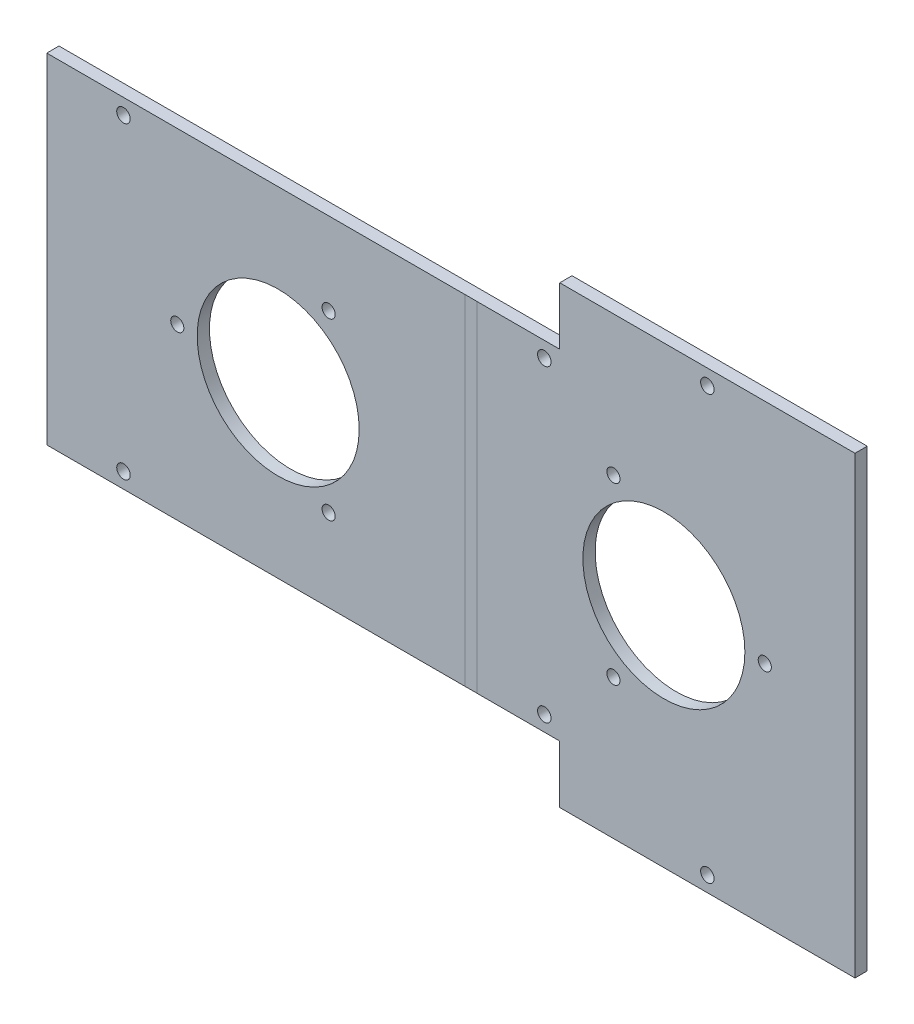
ISO-10303-21;
HEADER;
FILE_DESCRIPTION(('STEP AP214'),'2;1');
FILE_NAME('part.step','',(''),(''),'','','');
FILE_SCHEMA(('AUTOMOTIVE_DESIGN { 1 0 10303 214 1 1 1 1 }'));
ENDSEC;
DATA;
#1=APPLICATION_CONTEXT('core data for automotive mechanical design processes');
#2=APPLICATION_PROTOCOL_DEFINITION('international standard','automotive_design',2000,#1);
#3=PRODUCT_CONTEXT('',#1,'mechanical');
#4=PRODUCT('Part','Part','',(#3));
#5=PRODUCT_RELATED_PRODUCT_CATEGORY('part','',(#4));
#6=PRODUCT_DEFINITION_FORMATION('','',#4);
#7=PRODUCT_DEFINITION_CONTEXT('part definition',#1,'design');
#8=PRODUCT_DEFINITION('design','',#6,#7);
#9=PRODUCT_DEFINITION_SHAPE('','',#8);
#10=(LENGTH_UNIT() NAMED_UNIT(*) SI_UNIT(.MILLI.,.METRE.));
#11=(NAMED_UNIT(*) PLANE_ANGLE_UNIT() SI_UNIT($,.RADIAN.));
#12=(NAMED_UNIT(*) SI_UNIT($,.STERADIAN.) SOLID_ANGLE_UNIT());
#13=UNCERTAINTY_MEASURE_WITH_UNIT(LENGTH_MEASURE(1.E-05),#10,'distance_accuracy_value','');
#14=(GEOMETRIC_REPRESENTATION_CONTEXT(3) GLOBAL_UNCERTAINTY_ASSIGNED_CONTEXT((#13)) GLOBAL_UNIT_ASSIGNED_CONTEXT((#10,
#11,#12)) REPRESENTATION_CONTEXT('',''));
#15=CARTESIAN_POINT('',(0.,0.,0.));
#16=DIRECTION('',(0.,0.,1.));
#17=DIRECTION('',(1.,0.,0.));
#18=AXIS2_PLACEMENT_3D('',#15,#16,#17);
#19=CARTESIAN_POINT('',(-66.5,-500000.,114.05));
#20=DIRECTION('',(0.,0.,-1.));
#21=DIRECTION('',(-1.,0.,0.));
#22=AXIS2_PLACEMENT_3D('',#19,#20,#21);
#23=PLANE('',#22);
#24=CARTESIAN_POINT('',(80.4205213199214,-22.6543216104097,114.05));
#25=DIRECTION('',(0.,0.,1.));
#26=DIRECTION('',(1.,0.,0.));
#27=AXIS2_PLACEMENT_3D('',#24,#25,#26);
#28=CIRCLE('',#27,1.7);
#29=CARTESIAN_POINT('',(82.1205213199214,-22.6543216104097,114.05));
#30=VERTEX_POINT('',#29);
#31=EDGE_CURVE('E200',#30,#30,#28,.T.);
#32=ORIENTED_EDGE('',*,*,#31,.F.);
#33=EDGE_LOOP('',(#32));
#34=FACE_BOUND('',#33,.T.);
#35=CARTESIAN_POINT('',(119.658957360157,0.,114.05));
#36=DIRECTION('',(0.,0.,1.));
#37=DIRECTION('',(1.,0.,0.));
#38=AXIS2_PLACEMENT_3D('',#35,#36,#37);
#39=CIRCLE('',#38,1.70000000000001);
#40=CARTESIAN_POINT('',(121.358957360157,0.,114.05));
#41=VERTEX_POINT('',#40);
#42=EDGE_CURVE('E196',#41,#41,#39,.T.);
#43=ORIENTED_EDGE('',*,*,#42,.F.);
#44=EDGE_LOOP('',(#43));
#45=FACE_BOUND('',#44,.T.);
#46=CARTESIAN_POINT('',(93.5,0.,114.05));
#47=DIRECTION('',(0.,0.,1.));
#48=DIRECTION('',(1.,0.,0.));
#49=AXIS2_PLACEMENT_3D('',#46,#47,#48);
#50=CIRCLE('',#49,21.);
#51=CARTESIAN_POINT('',(114.5,0.,114.05));
#52=VERTEX_POINT('',#51);
#53=EDGE_CURVE('E206',#52,#52,#50,.T.);
#54=ORIENTED_EDGE('',*,*,#53,.F.);
#55=EDGE_LOOP('',(#54));
#56=FACE_BOUND('',#55,.T.);
#57=CARTESIAN_POINT('',(80.4205213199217,22.6543216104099,114.05));
#58=DIRECTION('',(0.,0.,1.));
#59=DIRECTION('',(1.,0.,0.));
#60=AXIS2_PLACEMENT_3D('',#57,#58,#59);
#61=CIRCLE('',#60,1.7);
#62=CARTESIAN_POINT('',(82.1205213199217,22.6543216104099,114.05));
#63=VERTEX_POINT('',#62);
#64=EDGE_CURVE('E199',#63,#63,#61,.T.);
#65=ORIENTED_EDGE('',*,*,#64,.F.);
#66=EDGE_LOOP('',(#65));
#67=FACE_BOUND('',#66,.T.);
#68=CARTESIAN_POINT('',(62.5,-39.99,114.05));
#69=DIRECTION('',(0.,0.,1.));
#70=DIRECTION('',(1.,0.,0.));
#71=AXIS2_PLACEMENT_3D('',#68,#69,#70);
#72=CIRCLE('',#71,1.75);
#73=CARTESIAN_POINT('',(64.25,-39.99,114.05));
#74=VERTEX_POINT('',#73);
#75=EDGE_CURVE('E174',#74,#74,#72,.T.);
#76=ORIENTED_EDGE('',*,*,#75,.F.);
#77=EDGE_LOOP('',(#76));
#78=FACE_BOUND('',#77,.T.);
#79=CARTESIAN_POINT('',(104.775,54.9125,114.05));
#80=DIRECTION('',(0.,0.,1.));
#81=DIRECTION('',(1.,0.,0.));
#82=AXIS2_PLACEMENT_3D('',#79,#80,#81);
#83=CIRCLE('',#82,1.75);
#84=CARTESIAN_POINT('',(106.525,54.9125,114.05));
#85=VERTEX_POINT('',#84);
#86=EDGE_CURVE('E186',#85,#85,#83,.T.);
#87=ORIENTED_EDGE('',*,*,#86,.F.);
#88=EDGE_LOOP('',(#87));
#89=FACE_BOUND('',#88,.T.);
#90=CARTESIAN_POINT('',(62.5,39.99,114.05));
#91=DIRECTION('',(0.,0.,1.));
#92=DIRECTION('',(1.,0.,0.));
#93=AXIS2_PLACEMENT_3D('',#90,#91,#92);
#94=CIRCLE('',#93,1.75);
#95=CARTESIAN_POINT('',(64.25,39.99,114.05));
#96=VERTEX_POINT('',#95);
#97=EDGE_CURVE('E173',#96,#96,#94,.T.);
#98=ORIENTED_EDGE('',*,*,#97,.F.);
#99=EDGE_LOOP('',(#98));
#100=FACE_BOUND('',#99,.T.);
#101=CARTESIAN_POINT('',(104.775,-54.9125,114.05));
#102=DIRECTION('',(0.,0.,1.));
#103=DIRECTION('',(1.,0.,0.));
#104=AXIS2_PLACEMENT_3D('',#101,#102,#103);
#105=CIRCLE('',#104,1.75);
#106=CARTESIAN_POINT('',(106.525,-54.9125,114.05));
#107=VERTEX_POINT('',#106);
#108=EDGE_CURVE('E160',#107,#107,#105,.T.);
#109=ORIENTED_EDGE('',*,*,#108,.F.);
#110=EDGE_LOOP('',(#109));
#111=FACE_BOUND('',#110,.T.);
#112=DIRECTION('',(-1.,0.,0.));
#113=VECTOR('',#112,1.);
#114=CARTESIAN_POINT('',(-66.5,43.99,114.05));
#115=LINE('',#114,#113);
#116=CARTESIAN_POINT('',(66.5,43.990000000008,114.05));
#117=VERTEX_POINT('',#116);
#118=CARTESIAN_POINT('',(45.0875,43.99,114.05));
#119=VERTEX_POINT('',#118);
#120=EDGE_CURVE('E284',#117,#119,#115,.T.);
#121=ORIENTED_EDGE('',*,*,#120,.T.);
#122=DIRECTION('',(0.,1.,0.));
#123=VECTOR('',#122,1.);
#124=CARTESIAN_POINT('',(45.0875,-43.99,114.05));
#125=LINE('',#124,#123);
#126=CARTESIAN_POINT('',(45.0875,-43.99,114.05));
#127=VERTEX_POINT('',#126);
#128=EDGE_CURVE('E130',#127,#119,#125,.T.);
#129=ORIENTED_EDGE('',*,*,#128,.F.);
#130=DIRECTION('',(-1.,0.,0.));
#131=VECTOR('',#130,1.);
#132=CARTESIAN_POINT('',(-66.5,-43.990000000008,114.05));
#133=LINE('',#132,#131);
#134=CARTESIAN_POINT('',(66.5,-43.990000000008,114.05));
#135=VERTEX_POINT('',#134);
#136=EDGE_CURVE('E11',#135,#127,#133,.T.);
#137=ORIENTED_EDGE('',*,*,#136,.F.);
#138=DIRECTION('',(0.,1.,0.));
#139=VECTOR('',#138,1.);
#140=CARTESIAN_POINT('',(66.5,-500000.,114.05));
#141=LINE('',#140,#139);
#142=CARTESIAN_POINT('',(66.5,-58.9125000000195,114.05));
#143=VERTEX_POINT('',#142);
#144=EDGE_CURVE('E251',#143,#135,#141,.T.);
#145=ORIENTED_EDGE('',*,*,#144,.F.);
#146=DIRECTION('',(-1.,0.,0.));
#147=VECTOR('',#146,1.);
#148=CARTESIAN_POINT('',(66.5,-58.9125000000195,114.05));
#149=LINE('',#148,#147);
#150=CARTESIAN_POINT('',(143.05,-58.9125000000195,114.05));
#151=VERTEX_POINT('',#150);
#152=EDGE_CURVE('E243',#151,#143,#149,.T.);
#153=ORIENTED_EDGE('',*,*,#152,.F.);
#154=DIRECTION('',(0.,1.,0.));
#155=VECTOR('',#154,1.);
#156=CARTESIAN_POINT('',(143.05,-500000.,114.05));
#157=LINE('',#156,#155);
#158=CARTESIAN_POINT('',(143.05,58.9125,114.05));
#159=VERTEX_POINT('',#158);
#160=EDGE_CURVE('E264',#151,#159,#157,.T.);
#161=ORIENTED_EDGE('',*,*,#160,.T.);
#162=DIRECTION('',(-1.,0.,0.));
#163=VECTOR('',#162,1.);
#164=CARTESIAN_POINT('',(66.5,58.9125,114.05));
#165=LINE('',#164,#163);
#166=CARTESIAN_POINT('',(66.5,58.9125,114.05));
#167=VERTEX_POINT('',#166);
#168=EDGE_CURVE('E248',#159,#167,#165,.T.);
#169=ORIENTED_EDGE('',*,*,#168,.T.);
#170=EDGE_CURVE('E266',#117,#167,#141,.T.);
#171=ORIENTED_EDGE('',*,*,#170,.F.);
#172=EDGE_LOOP('',(#121,#129,#137,#145,#153,#161,#169,#171));
#173=FACE_BOUND('',#172,.T.);
#174=ADVANCED_FACE('F34',(#34,#45,#56,#67,#78,#89,#100,#111,#173),#23,.F.);
#175=CARTESIAN_POINT('',(0.,-43.99,-240.705250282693));
#176=DIRECTION('',(0.,-1.,0.));
#177=DIRECTION('',(0.,0.,1.));
#178=AXIS2_PLACEMENT_3D('',#175,#176,#177);
#179=PLANE('',#178);
#180=DIRECTION('',(0.,0.,1.));
#181=VECTOR('',#180,1.);
#182=CARTESIAN_POINT('',(45.0875,-43.99,114.04));
#183=LINE('',#182,#181);
#184=CARTESIAN_POINT('',(45.0875,-43.99,114.04));
#185=VERTEX_POINT('',#184);
#186=EDGE_CURVE('E154',#185,#127,#183,.T.);
#187=ORIENTED_EDGE('',*,*,#186,.F.);
#188=DIRECTION('',(1.,0.,0.));
#189=VECTOR('',#188,1.);
#190=CARTESIAN_POINT('',(41.9125,-43.99,114.04));
#191=LINE('',#190,#189);
#192=CARTESIAN_POINT('',(41.9125,-43.99,114.04));
#193=VERTEX_POINT('',#192);
#194=EDGE_CURVE('E134',#193,#185,#191,.T.);
#195=ORIENTED_EDGE('',*,*,#194,.F.);
#196=DIRECTION('',(0.,0.,1.));
#197=VECTOR('',#196,1.);
#198=CARTESIAN_POINT('',(41.9125,-43.99,114.04));
#199=LINE('',#198,#197);
#200=CARTESIAN_POINT('',(41.9125,-43.99,114.05));
#201=VERTEX_POINT('',#200);
#202=EDGE_CURVE('E157',#193,#201,#199,.T.);
#203=ORIENTED_EDGE('',*,*,#202,.T.);
#204=CARTESIAN_POINT('',(-66.5,-43.990000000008,114.05));
#205=VERTEX_POINT('',#204);
#206=EDGE_CURVE('E43',#201,#205,#133,.T.);
#207=ORIENTED_EDGE('',*,*,#206,.T.);
#208=DIRECTION('',(0.,0.,-1.));
#209=VECTOR('',#208,1.);
#210=CARTESIAN_POINT('',(-66.5,-43.990000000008,114.05));
#211=LINE('',#210,#209);
#212=CARTESIAN_POINT('',(-66.5,-43.990000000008,110.875));
#213=VERTEX_POINT('',#212);
#214=EDGE_CURVE('E292',#205,#213,#211,.T.);
#215=ORIENTED_EDGE('',*,*,#214,.T.);
#216=DIRECTION('',(1.,0.,0.));
#217=VECTOR('',#216,1.);
#218=CARTESIAN_POINT('',(-66.5,-43.990000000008,110.875));
#219=LINE('',#218,#217);
#220=CARTESIAN_POINT('',(66.5,-43.990000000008,110.875));
#221=VERTEX_POINT('',#220);
#222=EDGE_CURVE('E38',#213,#221,#219,.T.);
#223=ORIENTED_EDGE('',*,*,#222,.T.);
#224=DIRECTION('',(0.,0.,1.));
#225=VECTOR('',#224,1.);
#226=CARTESIAN_POINT('',(66.5,-43.990000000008,114.05));
#227=LINE('',#226,#225);
#228=EDGE_CURVE('E295',#221,#135,#227,.T.);
#229=ORIENTED_EDGE('',*,*,#228,.T.);
#230=ORIENTED_EDGE('',*,*,#136,.T.);
#231=EDGE_LOOP('',(#187,#195,#203,#207,#215,#223,#229,#230));
#232=FACE_BOUND('',#231,.T.);
#233=ADVANCED_FACE('F36',(#232),#179,.T.);
#234=CARTESIAN_POINT('',(0.,43.99,0.));
#235=DIRECTION('',(0.,-1.,0.));
#236=DIRECTION('',(0.,0.,-1.));
#237=AXIS2_PLACEMENT_3D('',#234,#235,#236);
#238=PLANE('',#237);
#239=DIRECTION('',(-1.,0.,0.));
#240=VECTOR('',#239,1.);
#241=CARTESIAN_POINT('',(45.0875,43.99,114.04));
#242=LINE('',#241,#240);
#243=CARTESIAN_POINT('',(45.0875,43.99,114.04));
#244=VERTEX_POINT('',#243);
#245=CARTESIAN_POINT('',(41.9125,43.99,114.04));
#246=VERTEX_POINT('',#245);
#247=EDGE_CURVE('E140',#244,#246,#242,.T.);
#248=ORIENTED_EDGE('',*,*,#247,.F.);
#249=DIRECTION('',(0.,0.,1.));
#250=VECTOR('',#249,1.);
#251=CARTESIAN_POINT('',(45.0875,43.99,114.04));
#252=LINE('',#251,#250);
#253=EDGE_CURVE('E124',#244,#119,#252,.T.);
#254=ORIENTED_EDGE('',*,*,#253,.T.);
#255=ORIENTED_EDGE('',*,*,#120,.F.);
#256=DIRECTION('',(0.,0.,1.));
#257=VECTOR('',#256,1.);
#258=CARTESIAN_POINT('',(66.5,43.99,114.05));
#259=LINE('',#258,#257);
#260=CARTESIAN_POINT('',(66.5,43.99,110.875));
#261=VERTEX_POINT('',#260);
#262=EDGE_CURVE('E281',#261,#117,#259,.T.);
#263=ORIENTED_EDGE('',*,*,#262,.F.);
#264=DIRECTION('',(1.,0.,0.));
#265=VECTOR('',#264,1.);
#266=CARTESIAN_POINT('',(-66.5,43.99,110.875));
#267=LINE('',#266,#265);
#268=CARTESIAN_POINT('',(-66.5,43.99,110.875));
#269=VERTEX_POINT('',#268);
#270=EDGE_CURVE('E279',#269,#261,#267,.T.);
#271=ORIENTED_EDGE('',*,*,#270,.F.);
#272=DIRECTION('',(0.,0.,-1.));
#273=VECTOR('',#272,1.);
#274=CARTESIAN_POINT('',(-66.5,43.99,114.05));
#275=LINE('',#274,#273);
#276=CARTESIAN_POINT('',(-66.5,43.99,114.05));
#277=VERTEX_POINT('',#276);
#278=EDGE_CURVE('E255',#277,#269,#275,.T.);
#279=ORIENTED_EDGE('',*,*,#278,.F.);
#280=CARTESIAN_POINT('',(41.9125,43.99,114.05));
#281=VERTEX_POINT('',#280);
#282=EDGE_CURVE('E287',#281,#277,#115,.T.);
#283=ORIENTED_EDGE('',*,*,#282,.F.);
#284=DIRECTION('',(0.,0.,1.));
#285=VECTOR('',#284,1.);
#286=CARTESIAN_POINT('',(41.9125,43.99,114.04));
#287=LINE('',#286,#285);
#288=EDGE_CURVE('E51',#246,#281,#287,.T.);
#289=ORIENTED_EDGE('',*,*,#288,.F.);
#290=EDGE_LOOP('',(#248,#254,#255,#263,#271,#279,#283,#289));
#291=FACE_BOUND('',#290,.T.);
#292=ADVANCED_FACE('F145',(#291),#238,.F.);
#293=CARTESIAN_POINT('',(-66.5,-500000.,110.875));
#294=DIRECTION('',(0.,0.,1.));
#295=DIRECTION('',(1.,0.,0.));
#296=AXIS2_PLACEMENT_3D('',#293,#294,#295);
#297=PLANE('',#296);
#298=CARTESIAN_POINT('',(104.775,-54.9125,110.875));
#299=DIRECTION('',(0.,0.,1.));
#300=DIRECTION('',(1.,0.,0.));
#301=AXIS2_PLACEMENT_3D('',#298,#299,#300);
#302=CIRCLE('',#301,1.75);
#303=CARTESIAN_POINT('',(106.525,-54.9125,110.875));
#304=VERTEX_POINT('',#303);
#305=EDGE_CURVE('E163',#304,#304,#302,.F.);
#306=ORIENTED_EDGE('',*,*,#305,.F.);
#307=EDGE_LOOP('',(#306));
#308=FACE_BOUND('',#307,.T.);
#309=CARTESIAN_POINT('',(-46.609,39.99,110.875));
#310=DIRECTION('',(0.,0.,1.));
#311=DIRECTION('',(1.,0.,0.));
#312=AXIS2_PLACEMENT_3D('',#309,#310,#311);
#313=CIRCLE('',#312,1.75);
#314=CARTESIAN_POINT('',(-44.859,39.99,110.875));
#315=VERTEX_POINT('',#314);
#316=EDGE_CURVE('E170',#315,#315,#313,.F.);
#317=ORIENTED_EDGE('',*,*,#316,.F.);
#318=EDGE_LOOP('',(#317));
#319=FACE_BOUND('',#318,.T.);
#320=CARTESIAN_POINT('',(62.5,39.99,110.875));
#321=DIRECTION('',(0.,0.,1.));
#322=DIRECTION('',(1.,0.,0.));
#323=AXIS2_PLACEMENT_3D('',#320,#321,#322);
#324=CIRCLE('',#323,1.75);
#325=CARTESIAN_POINT('',(64.25,39.99,110.875));
#326=VERTEX_POINT('',#325);
#327=EDGE_CURVE('E189',#326,#326,#324,.F.);
#328=ORIENTED_EDGE('',*,*,#327,.F.);
#329=EDGE_LOOP('',(#328));
#330=FACE_BOUND('',#329,.T.);
#331=CARTESIAN_POINT('',(104.775,54.9125,110.875));
#332=DIRECTION('',(0.,0.,1.));
#333=DIRECTION('',(1.,0.,0.));
#334=AXIS2_PLACEMENT_3D('',#331,#332,#333);
#335=CIRCLE('',#334,1.75);
#336=CARTESIAN_POINT('',(106.525,54.9125,110.875));
#337=VERTEX_POINT('',#336);
#338=EDGE_CURVE('E183',#337,#337,#335,.F.);
#339=ORIENTED_EDGE('',*,*,#338,.F.);
#340=EDGE_LOOP('',(#339));
#341=FACE_BOUND('',#340,.T.);
#342=CARTESIAN_POINT('',(-46.609,-39.99,110.875));
#343=DIRECTION('',(0.,0.,1.));
#344=DIRECTION('',(1.,0.,0.));
#345=AXIS2_PLACEMENT_3D('',#342,#343,#344);
#346=CIRCLE('',#345,1.75);
#347=CARTESIAN_POINT('',(-44.859,-39.99,110.875));
#348=VERTEX_POINT('',#347);
#349=EDGE_CURVE('E177',#348,#348,#346,.F.);
#350=ORIENTED_EDGE('',*,*,#349,.F.);
#351=EDGE_LOOP('',(#350));
#352=FACE_BOUND('',#351,.T.);
#353=CARTESIAN_POINT('',(62.5,-39.99,110.875));
#354=DIRECTION('',(0.,0.,1.));
#355=DIRECTION('',(1.,0.,0.));
#356=AXIS2_PLACEMENT_3D('',#353,#354,#355);
#357=CIRCLE('',#356,1.75);
#358=CARTESIAN_POINT('',(64.25,-39.99,110.875));
#359=VERTEX_POINT('',#358);
#360=EDGE_CURVE('E164',#359,#359,#357,.F.);
#361=ORIENTED_EDGE('',*,*,#360,.F.);
#362=EDGE_LOOP('',(#361));
#363=FACE_BOUND('',#362,.T.);
#364=CARTESIAN_POINT('',(6.5794786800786,-22.6543216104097,110.875));
#365=DIRECTION('',(0.,0.,1.));
#366=DIRECTION('',(1.,0.,0.));
#367=AXIS2_PLACEMENT_3D('',#364,#365,#366);
#368=CIRCLE('',#367,1.7);
#369=CARTESIAN_POINT('',(8.2794786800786,-22.6543216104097,110.875));
#370=VERTEX_POINT('',#369);
#371=EDGE_CURVE('E240',#370,#370,#368,.T.);
#372=ORIENTED_EDGE('',*,*,#371,.T.);
#373=EDGE_LOOP('',(#372));
#374=FACE_BOUND('',#373,.T.);
#375=CARTESIAN_POINT('',(-32.6589573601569,0.,110.875));
#376=DIRECTION('',(0.,0.,1.));
#377=DIRECTION('',(1.,0.,0.));
#378=AXIS2_PLACEMENT_3D('',#375,#376,#377);
#379=CIRCLE('',#378,1.7);
#380=CARTESIAN_POINT('',(-30.9589573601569,0.,110.875));
#381=VERTEX_POINT('',#380);
#382=EDGE_CURVE('E237',#381,#381,#379,.T.);
#383=ORIENTED_EDGE('',*,*,#382,.T.);
#384=EDGE_LOOP('',(#383));
#385=FACE_BOUND('',#384,.T.);
#386=CARTESIAN_POINT('',(6.57947868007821,22.65432161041,110.875));
#387=DIRECTION('',(0.,0.,1.));
#388=DIRECTION('',(1.,0.,0.));
#389=AXIS2_PLACEMENT_3D('',#386,#387,#388);
#390=CIRCLE('',#389,1.7);
#391=CARTESIAN_POINT('',(8.27947868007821,22.65432161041,110.875));
#392=VERTEX_POINT('',#391);
#393=EDGE_CURVE('E234',#392,#392,#390,.T.);
#394=ORIENTED_EDGE('',*,*,#393,.T.);
#395=EDGE_LOOP('',(#394));
#396=FACE_BOUND('',#395,.T.);
#397=CARTESIAN_POINT('',(80.4205213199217,22.6543216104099,110.875));
#398=DIRECTION('',(0.,0.,1.));
#399=DIRECTION('',(1.,0.,0.));
#400=AXIS2_PLACEMENT_3D('',#397,#398,#399);
#401=CIRCLE('',#400,1.7);
#402=CARTESIAN_POINT('',(82.1205213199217,22.6543216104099,110.875));
#403=VERTEX_POINT('',#402);
#404=EDGE_CURVE('E231',#403,#403,#401,.T.);
#405=ORIENTED_EDGE('',*,*,#404,.T.);
#406=EDGE_LOOP('',(#405));
#407=FACE_BOUND('',#406,.T.);
#408=CARTESIAN_POINT('',(93.5,0.,110.875));
#409=DIRECTION('',(0.,0.,1.));
#410=DIRECTION('',(1.,0.,0.));
#411=AXIS2_PLACEMENT_3D('',#408,#409,#410);
#412=CIRCLE('',#411,21.);
#413=CARTESIAN_POINT('',(114.5,0.,110.875));
#414=VERTEX_POINT('',#413);
#415=EDGE_CURVE('E228',#414,#414,#412,.T.);
#416=ORIENTED_EDGE('',*,*,#415,.T.);
#417=EDGE_LOOP('',(#416));
#418=FACE_BOUND('',#417,.T.);
#419=CARTESIAN_POINT('',(119.658957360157,0.,110.875));
#420=DIRECTION('',(0.,0.,1.));
#421=DIRECTION('',(1.,0.,0.));
#422=AXIS2_PLACEMENT_3D('',#419,#420,#421);
#423=CIRCLE('',#422,1.70000000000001);
#424=CARTESIAN_POINT('',(121.358957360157,0.,110.875));
#425=VERTEX_POINT('',#424);
#426=EDGE_CURVE('E225',#425,#425,#423,.T.);
#427=ORIENTED_EDGE('',*,*,#426,.T.);
#428=EDGE_LOOP('',(#427));
#429=FACE_BOUND('',#428,.T.);
#430=CARTESIAN_POINT('',(80.4205213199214,-22.6543216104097,110.875));
#431=DIRECTION('',(0.,0.,1.));
#432=DIRECTION('',(1.,0.,0.));
#433=AXIS2_PLACEMENT_3D('',#430,#431,#432);
#434=CIRCLE('',#433,1.7);
#435=CARTESIAN_POINT('',(82.1205213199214,-22.6543216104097,110.875));
#436=VERTEX_POINT('',#435);
#437=EDGE_CURVE('E222',#436,#436,#434,.T.);
#438=ORIENTED_EDGE('',*,*,#437,.T.);
#439=EDGE_LOOP('',(#438));
#440=FACE_BOUND('',#439,.T.);
#441=CARTESIAN_POINT('',(-6.50000000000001,0.,110.875));
#442=DIRECTION('',(0.,0.,1.));
#443=DIRECTION('',(1.,0.,0.));
#444=AXIS2_PLACEMENT_3D('',#441,#442,#443);
#445=CIRCLE('',#444,21.);
#446=CARTESIAN_POINT('',(14.5,0.,110.875));
#447=VERTEX_POINT('',#446);
#448=EDGE_CURVE('E219',#447,#447,#445,.T.);
#449=ORIENTED_EDGE('',*,*,#448,.T.);
#450=EDGE_LOOP('',(#449));
#451=FACE_BOUND('',#450,.T.);
#452=ORIENTED_EDGE('',*,*,#222,.F.);
#453=DIRECTION('',(0.,1.,0.));
#454=VECTOR('',#453,1.);
#455=CARTESIAN_POINT('',(-66.5,-500000.,110.875));
#456=LINE('',#455,#454);
#457=EDGE_CURVE('E290',#213,#269,#456,.T.);
#458=ORIENTED_EDGE('',*,*,#457,.T.);
#459=ORIENTED_EDGE('',*,*,#270,.T.);
#460=DIRECTION('',(0.,1.,0.));
#461=VECTOR('',#460,1.);
#462=CARTESIAN_POINT('',(66.5,-500000.,110.875));
#463=LINE('',#462,#461);
#464=CARTESIAN_POINT('',(66.5,58.9125,110.875));
#465=VERTEX_POINT('',#464);
#466=EDGE_CURVE('E262',#261,#465,#463,.T.);
#467=ORIENTED_EDGE('',*,*,#466,.T.);
#468=DIRECTION('',(1.,0.,0.));
#469=VECTOR('',#468,1.);
#470=CARTESIAN_POINT('',(66.5,58.9125,110.875));
#471=LINE('',#470,#469);
#472=CARTESIAN_POINT('',(143.05,58.9125,110.875));
#473=VERTEX_POINT('',#472);
#474=EDGE_CURVE('E247',#465,#473,#471,.T.);
#475=ORIENTED_EDGE('',*,*,#474,.T.);
#476=DIRECTION('',(0.,1.,0.));
#477=VECTOR('',#476,1.);
#478=CARTESIAN_POINT('',(143.05,-500000.,110.875));
#479=LINE('',#478,#477);
#480=CARTESIAN_POINT('',(143.05,-58.9125000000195,110.875));
#481=VERTEX_POINT('',#480);
#482=EDGE_CURVE('E261',#481,#473,#479,.T.);
#483=ORIENTED_EDGE('',*,*,#482,.F.);
#484=DIRECTION('',(1.,0.,0.));
#485=VECTOR('',#484,1.);
#486=CARTESIAN_POINT('',(66.5,-58.9125000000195,110.875));
#487=LINE('',#486,#485);
#488=CARTESIAN_POINT('',(66.5,-58.9125000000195,110.875));
#489=VERTEX_POINT('',#488);
#490=EDGE_CURVE('E271',#489,#481,#487,.T.);
#491=ORIENTED_EDGE('',*,*,#490,.F.);
#492=EDGE_CURVE('E258',#489,#221,#463,.T.);
#493=ORIENTED_EDGE('',*,*,#492,.T.);
#494=EDGE_LOOP('',(#452,#458,#459,#467,#475,#483,#491,#493));
#495=FACE_BOUND('',#494,.T.);
#496=ADVANCED_FACE('F306',(#308,#319,#330,#341,#352,#363,#374,#385,#396,#407,#418,#429,#440,
#451,#495),#297,.F.);
#497=CARTESIAN_POINT('',(-46.609,39.99,114.05));
#498=DIRECTION('',(0.,0.,1.));
#499=DIRECTION('',(1.,0.,0.));
#500=AXIS2_PLACEMENT_3D('',#497,#498,#499);
#501=CIRCLE('',#500,1.75);
#502=CARTESIAN_POINT('',(-44.859,39.99,114.05));
#503=VERTEX_POINT('',#502);
#504=EDGE_CURVE('E156',#503,#503,#501,.T.);
#505=ORIENTED_EDGE('',*,*,#504,.F.);
#506=EDGE_LOOP('',(#505));
#507=FACE_BOUND('',#506,.T.);
#508=CARTESIAN_POINT('',(-46.609,-39.99,114.05));
#509=DIRECTION('',(0.,0.,1.));
#510=DIRECTION('',(1.,0.,0.));
#511=AXIS2_PLACEMENT_3D('',#508,#509,#510);
#512=CIRCLE('',#511,1.75);
#513=CARTESIAN_POINT('',(-44.859,-39.99,114.05));
#514=VERTEX_POINT('',#513);
#515=EDGE_CURVE('E180',#514,#514,#512,.T.);
#516=ORIENTED_EDGE('',*,*,#515,.F.);
#517=EDGE_LOOP('',(#516));
#518=FACE_BOUND('',#517,.T.);
#519=CARTESIAN_POINT('',(6.5794786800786,-22.6543216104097,114.05));
#520=DIRECTION('',(0.,0.,1.));
#521=DIRECTION('',(1.,0.,0.));
#522=AXIS2_PLACEMENT_3D('',#519,#520,#521);
#523=CIRCLE('',#522,1.7);
#524=CARTESIAN_POINT('',(8.2794786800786,-22.6543216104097,114.05));
#525=VERTEX_POINT('',#524);
#526=EDGE_CURVE('E167',#525,#525,#523,.T.);
#527=ORIENTED_EDGE('',*,*,#526,.F.);
#528=EDGE_LOOP('',(#527));
#529=FACE_BOUND('',#528,.T.);
#530=CARTESIAN_POINT('',(-32.6589573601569,0.,114.05));
#531=DIRECTION('',(0.,0.,1.));
#532=DIRECTION('',(1.,0.,0.));
#533=AXIS2_PLACEMENT_3D('',#530,#531,#532);
#534=CIRCLE('',#533,1.7);
#535=CARTESIAN_POINT('',(-30.9589573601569,0.,114.05));
#536=VERTEX_POINT('',#535);
#537=EDGE_CURVE('E212',#536,#536,#534,.T.);
#538=ORIENTED_EDGE('',*,*,#537,.F.);
#539=EDGE_LOOP('',(#538));
#540=FACE_BOUND('',#539,.T.);
#541=CARTESIAN_POINT('',(6.57947868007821,22.65432161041,114.05));
#542=DIRECTION('',(0.,0.,1.));
#543=DIRECTION('',(1.,0.,0.));
#544=AXIS2_PLACEMENT_3D('',#541,#542,#543);
#545=CIRCLE('',#544,1.7);
#546=CARTESIAN_POINT('',(8.27947868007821,22.65432161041,114.05));
#547=VERTEX_POINT('',#546);
#548=EDGE_CURVE('E203',#547,#547,#545,.T.);
#549=ORIENTED_EDGE('',*,*,#548,.F.);
#550=EDGE_LOOP('',(#549));
#551=FACE_BOUND('',#550,.T.);
#552=CARTESIAN_POINT('',(-6.50000000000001,0.,114.05));
#553=DIRECTION('',(0.,0.,1.));
#554=DIRECTION('',(1.,0.,0.));
#555=AXIS2_PLACEMENT_3D('',#552,#553,#554);
#556=CIRCLE('',#555,21.);
#557=CARTESIAN_POINT('',(14.5,0.,114.05));
#558=VERTEX_POINT('',#557);
#559=EDGE_CURVE('E209',#558,#558,#556,.T.);
#560=ORIENTED_EDGE('',*,*,#559,.F.);
#561=EDGE_LOOP('',(#560));
#562=FACE_BOUND('',#561,.T.);
#563=ORIENTED_EDGE('',*,*,#206,.F.);
#564=DIRECTION('',(0.,-1.,0.));
#565=VECTOR('',#564,1.);
#566=CARTESIAN_POINT('',(41.9125,43.99,114.05));
#567=LINE('',#566,#565);
#568=EDGE_CURVE('E143',#281,#201,#567,.T.);
#569=ORIENTED_EDGE('',*,*,#568,.F.);
#570=ORIENTED_EDGE('',*,*,#282,.T.);
#571=DIRECTION('',(0.,1.,0.));
#572=VECTOR('',#571,1.);
#573=CARTESIAN_POINT('',(-66.5,-500000.,114.05));
#574=LINE('',#573,#572);
#575=EDGE_CURVE('E286',#205,#277,#574,.T.);
#576=ORIENTED_EDGE('',*,*,#575,.F.);
#577=EDGE_LOOP('',(#563,#569,#570,#576));
#578=FACE_BOUND('',#577,.T.);
#579=ADVANCED_FACE('F314',(#507,#518,#529,#540,#551,#562,#578),#23,.F.);
#580=CARTESIAN_POINT('',(-66.5,-500000.,114.05));
#581=DIRECTION('',(1.,0.,0.));
#582=DIRECTION('',(0.,0.,-1.));
#583=AXIS2_PLACEMENT_3D('',#580,#581,#582);
#584=PLANE('',#583);
#585=ORIENTED_EDGE('',*,*,#214,.F.);
#586=ORIENTED_EDGE('',*,*,#575,.T.);
#587=ORIENTED_EDGE('',*,*,#278,.T.);
#588=ORIENTED_EDGE('',*,*,#457,.F.);
#589=EDGE_LOOP('',(#585,#586,#587,#588));
#590=FACE_BOUND('',#589,.T.);
#591=ADVANCED_FACE('F317',(#590),#584,.F.);
#592=CARTESIAN_POINT('',(66.5,-500000.,114.05));
#593=DIRECTION('',(1.,0.,0.));
#594=DIRECTION('',(0.,0.,-1.));
#595=AXIS2_PLACEMENT_3D('',#592,#593,#594);
#596=PLANE('',#595);
#597=ORIENTED_EDGE('',*,*,#466,.F.);
#598=ORIENTED_EDGE('',*,*,#262,.T.);
#599=ORIENTED_EDGE('',*,*,#170,.T.);
#600=DIRECTION('',(0.,0.,-1.));
#601=VECTOR('',#600,1.);
#602=CARTESIAN_POINT('',(66.5,58.9125,114.05));
#603=LINE('',#602,#601);
#604=EDGE_CURVE('E252',#167,#465,#603,.T.);
#605=ORIENTED_EDGE('',*,*,#604,.T.);
#606=EDGE_LOOP('',(#597,#598,#599,#605));
#607=FACE_BOUND('',#606,.T.);
#608=ADVANCED_FACE('F328',(#607),#596,.F.);
#609=CARTESIAN_POINT('',(0.,-58.9125,-240.705250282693));
#610=DIRECTION('',(0.,-1.,0.));
#611=DIRECTION('',(0.,0.,1.));
#612=AXIS2_PLACEMENT_3D('',#609,#610,#611);
#613=PLANE('',#612);
#614=ORIENTED_EDGE('',*,*,#490,.T.);
#615=DIRECTION('',(0.,0.,1.));
#616=VECTOR('',#615,1.);
#617=CARTESIAN_POINT('',(143.05,-58.9125,-240.705250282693));
#618=LINE('',#617,#616);
#619=EDGE_CURVE('E274',#481,#151,#618,.T.);
#620=ORIENTED_EDGE('',*,*,#619,.T.);
#621=ORIENTED_EDGE('',*,*,#152,.T.);
#622=DIRECTION('',(0.,0.,-1.));
#623=VECTOR('',#622,1.);
#624=CARTESIAN_POINT('',(66.5,-58.9125000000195,114.05));
#625=LINE('',#624,#623);
#626=EDGE_CURVE('E269',#143,#489,#625,.T.);
#627=ORIENTED_EDGE('',*,*,#626,.T.);
#628=EDGE_LOOP('',(#614,#620,#621,#627));
#629=FACE_BOUND('',#628,.T.);
#630=ADVANCED_FACE('F309',(#629),#613,.T.);
#631=CARTESIAN_POINT('',(0.,58.9125,0.));
#632=DIRECTION('',(0.,-1.,0.));
#633=DIRECTION('',(0.,0.,-1.));
#634=AXIS2_PLACEMENT_3D('',#631,#632,#633);
#635=PLANE('',#634);
#636=ORIENTED_EDGE('',*,*,#604,.F.);
#637=ORIENTED_EDGE('',*,*,#168,.F.);
#638=DIRECTION('',(0.,0.,1.));
#639=VECTOR('',#638,1.);
#640=CARTESIAN_POINT('',(143.05,58.9125,114.05));
#641=LINE('',#640,#639);
#642=EDGE_CURVE('E244',#473,#159,#641,.T.);
#643=ORIENTED_EDGE('',*,*,#642,.F.);
#644=ORIENTED_EDGE('',*,*,#474,.F.);
#645=EDGE_LOOP('',(#636,#637,#643,#644));
#646=FACE_BOUND('',#645,.T.);
#647=ADVANCED_FACE('F326',(#646),#635,.F.);
#648=ORIENTED_EDGE('',*,*,#228,.F.);
#649=ORIENTED_EDGE('',*,*,#492,.F.);
#650=ORIENTED_EDGE('',*,*,#626,.F.);
#651=ORIENTED_EDGE('',*,*,#144,.T.);
#652=EDGE_LOOP('',(#648,#649,#650,#651));
#653=FACE_BOUND('',#652,.T.);
#654=ADVANCED_FACE('F303',(#653),#596,.F.);
#655=CARTESIAN_POINT('',(143.05,-500000.,114.05));
#656=DIRECTION('',(-1.,0.,0.));
#657=DIRECTION('',(0.,0.,1.));
#658=AXIS2_PLACEMENT_3D('',#655,#656,#657);
#659=PLANE('',#658);
#660=ORIENTED_EDGE('',*,*,#619,.F.);
#661=ORIENTED_EDGE('',*,*,#482,.T.);
#662=ORIENTED_EDGE('',*,*,#642,.T.);
#663=ORIENTED_EDGE('',*,*,#160,.F.);
#664=EDGE_LOOP('',(#660,#661,#662,#663));
#665=FACE_BOUND('',#664,.T.);
#666=ADVANCED_FACE('F331',(#665),#659,.F.);
#667=CARTESIAN_POINT('',(-6.50000000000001,0.,52.8318969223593));
#668=DIRECTION('',(0.,0.,1.));
#669=DIRECTION('',(1.,0.,0.));
#670=AXIS2_PLACEMENT_3D('',#667,#668,#669);
#671=CYLINDRICAL_SURFACE('',#670,21.);
#672=ORIENTED_EDGE('',*,*,#559,.T.);
#673=EDGE_LOOP('',(#672));
#674=FACE_BOUND('',#673,.T.);
#675=ORIENTED_EDGE('',*,*,#448,.F.);
#676=EDGE_LOOP('',(#675));
#677=FACE_BOUND('',#676,.T.);
#678=ADVANCED_FACE('F333',(#674,#677),#671,.F.);
#679=CARTESIAN_POINT('',(80.4205213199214,-22.6543216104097,52.8318969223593));
#680=DIRECTION('',(0.,0.,1.));
#681=DIRECTION('',(1.,0.,0.));
#682=AXIS2_PLACEMENT_3D('',#679,#680,#681);
#683=CYLINDRICAL_SURFACE('',#682,1.7);
#684=ORIENTED_EDGE('',*,*,#31,.T.);
#685=EDGE_LOOP('',(#684));
#686=FACE_BOUND('',#685,.T.);
#687=ORIENTED_EDGE('',*,*,#437,.F.);
#688=EDGE_LOOP('',(#687));
#689=FACE_BOUND('',#688,.T.);
#690=ADVANCED_FACE('F339',(#686,#689),#683,.F.);
#691=CARTESIAN_POINT('',(119.658957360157,0.,52.8318969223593));
#692=DIRECTION('',(0.,0.,1.));
#693=DIRECTION('',(1.,0.,0.));
#694=AXIS2_PLACEMENT_3D('',#691,#692,#693);
#695=CYLINDRICAL_SURFACE('',#694,1.70000000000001);
#696=ORIENTED_EDGE('',*,*,#42,.T.);
#697=EDGE_LOOP('',(#696));
#698=FACE_BOUND('',#697,.T.);
#699=ORIENTED_EDGE('',*,*,#426,.F.);
#700=EDGE_LOOP('',(#699));
#701=FACE_BOUND('',#700,.T.);
#702=ADVANCED_FACE('F397',(#698,#701),#695,.F.);
#703=CARTESIAN_POINT('',(93.5,0.,52.8318969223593));
#704=DIRECTION('',(0.,0.,1.));
#705=DIRECTION('',(1.,0.,0.));
#706=AXIS2_PLACEMENT_3D('',#703,#704,#705);
#707=CYLINDRICAL_SURFACE('',#706,21.);
#708=ORIENTED_EDGE('',*,*,#53,.T.);
#709=EDGE_LOOP('',(#708));
#710=FACE_BOUND('',#709,.T.);
#711=ORIENTED_EDGE('',*,*,#415,.F.);
#712=EDGE_LOOP('',(#711));
#713=FACE_BOUND('',#712,.T.);
#714=ADVANCED_FACE('F403',(#710,#713),#707,.F.);
#715=CARTESIAN_POINT('',(80.4205213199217,22.6543216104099,52.8318969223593));
#716=DIRECTION('',(0.,0.,1.));
#717=DIRECTION('',(1.,0.,0.));
#718=AXIS2_PLACEMENT_3D('',#715,#716,#717);
#719=CYLINDRICAL_SURFACE('',#718,1.7);
#720=ORIENTED_EDGE('',*,*,#64,.T.);
#721=EDGE_LOOP('',(#720));
#722=FACE_BOUND('',#721,.T.);
#723=ORIENTED_EDGE('',*,*,#404,.F.);
#724=EDGE_LOOP('',(#723));
#725=FACE_BOUND('',#724,.T.);
#726=ADVANCED_FACE('F383',(#722,#725),#719,.F.);
#727=CARTESIAN_POINT('',(6.57947868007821,22.65432161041,52.8318969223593));
#728=DIRECTION('',(0.,0.,1.));
#729=DIRECTION('',(1.,0.,0.));
#730=AXIS2_PLACEMENT_3D('',#727,#728,#729);
#731=CYLINDRICAL_SURFACE('',#730,1.7);
#732=ORIENTED_EDGE('',*,*,#548,.T.);
#733=EDGE_LOOP('',(#732));
#734=FACE_BOUND('',#733,.T.);
#735=ORIENTED_EDGE('',*,*,#393,.F.);
#736=EDGE_LOOP('',(#735));
#737=FACE_BOUND('',#736,.T.);
#738=ADVANCED_FACE('F379',(#734,#737),#731,.F.);
#739=CARTESIAN_POINT('',(-32.6589573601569,0.,52.8318969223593));
#740=DIRECTION('',(0.,0.,1.));
#741=DIRECTION('',(1.,0.,0.));
#742=AXIS2_PLACEMENT_3D('',#739,#740,#741);
#743=CYLINDRICAL_SURFACE('',#742,1.7);
#744=ORIENTED_EDGE('',*,*,#537,.T.);
#745=EDGE_LOOP('',(#744));
#746=FACE_BOUND('',#745,.T.);
#747=ORIENTED_EDGE('',*,*,#382,.F.);
#748=EDGE_LOOP('',(#747));
#749=FACE_BOUND('',#748,.T.);
#750=ADVANCED_FACE('F382',(#746,#749),#743,.F.);
#751=CARTESIAN_POINT('',(6.5794786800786,-22.6543216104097,52.8318969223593));
#752=DIRECTION('',(0.,0.,1.));
#753=DIRECTION('',(1.,0.,0.));
#754=AXIS2_PLACEMENT_3D('',#751,#752,#753);
#755=CYLINDRICAL_SURFACE('',#754,1.7);
#756=ORIENTED_EDGE('',*,*,#526,.T.);
#757=EDGE_LOOP('',(#756));
#758=FACE_BOUND('',#757,.T.);
#759=ORIENTED_EDGE('',*,*,#371,.F.);
#760=EDGE_LOOP('',(#759));
#761=FACE_BOUND('',#760,.T.);
#762=ADVANCED_FACE('F416',(#758,#761),#755,.F.);
#763=CARTESIAN_POINT('',(62.5,-39.99,52.8308969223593));
#764=DIRECTION('',(0.,0.,1.));
#765=DIRECTION('',(1.,0.,0.));
#766=AXIS2_PLACEMENT_3D('',#763,#764,#765);
#767=CYLINDRICAL_SURFACE('',#766,1.75);
#768=CARTESIAN_POINT('',(64.25,-39.99,114.05));
#769=CARTESIAN_POINT('',(64.25,-39.99,114.016927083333));
#770=CARTESIAN_POINT('',(64.25,-39.99,113.983854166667));
#771=CARTESIAN_POINT('',(64.25,-39.99,113.917708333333));
#772=CARTESIAN_POINT('',(64.25,-39.99,113.884635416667));
#773=CARTESIAN_POINT('',(64.25,-39.99,113.818489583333));
#774=CARTESIAN_POINT('',(64.25,-39.99,113.785416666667));
#775=CARTESIAN_POINT('',(64.25,-39.99,113.719270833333));
#776=CARTESIAN_POINT('',(64.25,-39.99,113.686197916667));
#777=CARTESIAN_POINT('',(64.25,-39.99,113.620052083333));
#778=CARTESIAN_POINT('',(64.25,-39.99,113.586979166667));
#779=CARTESIAN_POINT('',(64.25,-39.99,113.520833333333));
#780=CARTESIAN_POINT('',(64.25,-39.99,113.487760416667));
#781=CARTESIAN_POINT('',(64.25,-39.99,113.421614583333));
#782=CARTESIAN_POINT('',(64.25,-39.99,113.388541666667));
#783=CARTESIAN_POINT('',(64.25,-39.99,113.322395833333));
#784=CARTESIAN_POINT('',(64.25,-39.99,113.289322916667));
#785=CARTESIAN_POINT('',(64.25,-39.99,113.223177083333));
#786=CARTESIAN_POINT('',(64.25,-39.99,113.190104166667));
#787=CARTESIAN_POINT('',(64.25,-39.99,113.123958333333));
#788=CARTESIAN_POINT('',(64.25,-39.99,113.090885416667));
#789=CARTESIAN_POINT('',(64.25,-39.99,113.024739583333));
#790=CARTESIAN_POINT('',(64.25,-39.99,112.991666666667));
#791=CARTESIAN_POINT('',(64.25,-39.99,112.925520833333));
#792=CARTESIAN_POINT('',(64.25,-39.99,112.892447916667));
#793=CARTESIAN_POINT('',(64.25,-39.99,112.826302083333));
#794=CARTESIAN_POINT('',(64.25,-39.99,112.793229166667));
#795=CARTESIAN_POINT('',(64.25,-39.99,112.727083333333));
#796=CARTESIAN_POINT('',(64.25,-39.99,112.694010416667));
#797=CARTESIAN_POINT('',(64.25,-39.99,112.627864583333));
#798=CARTESIAN_POINT('',(64.25,-39.99,112.594791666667));
#799=CARTESIAN_POINT('',(64.25,-39.99,112.528645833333));
#800=CARTESIAN_POINT('',(64.25,-39.99,112.495572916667));
#801=CARTESIAN_POINT('',(64.25,-39.99,112.429427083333));
#802=CARTESIAN_POINT('',(64.25,-39.99,112.396354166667));
#803=CARTESIAN_POINT('',(64.25,-39.99,112.330208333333));
#804=CARTESIAN_POINT('',(64.25,-39.99,112.297135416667));
#805=CARTESIAN_POINT('',(64.25,-39.99,112.230989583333));
#806=CARTESIAN_POINT('',(64.25,-39.99,112.197916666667));
#807=CARTESIAN_POINT('',(64.25,-39.99,112.131770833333));
#808=CARTESIAN_POINT('',(64.25,-39.99,112.098697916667));
#809=CARTESIAN_POINT('',(64.25,-39.99,112.032552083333));
#810=CARTESIAN_POINT('',(64.25,-39.99,111.999479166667));
#811=CARTESIAN_POINT('',(64.25,-39.99,111.933333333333));
#812=CARTESIAN_POINT('',(64.25,-39.99,111.900260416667));
#813=CARTESIAN_POINT('',(64.25,-39.99,111.834114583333));
#814=CARTESIAN_POINT('',(64.25,-39.99,111.801041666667));
#815=CARTESIAN_POINT('',(64.25,-39.99,111.734895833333));
#816=CARTESIAN_POINT('',(64.25,-39.99,111.701822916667));
#817=CARTESIAN_POINT('',(64.25,-39.99,111.635677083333));
#818=CARTESIAN_POINT('',(64.25,-39.99,111.602604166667));
#819=CARTESIAN_POINT('',(64.25,-39.99,111.536458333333));
#820=CARTESIAN_POINT('',(64.25,-39.99,111.503385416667));
#821=CARTESIAN_POINT('',(64.25,-39.99,111.437239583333));
#822=CARTESIAN_POINT('',(64.25,-39.99,111.404166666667));
#823=CARTESIAN_POINT('',(64.25,-39.99,111.338020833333));
#824=CARTESIAN_POINT('',(64.25,-39.99,111.304947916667));
#825=CARTESIAN_POINT('',(64.25,-39.99,111.238802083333));
#826=CARTESIAN_POINT('',(64.25,-39.99,111.205729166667));
#827=CARTESIAN_POINT('',(64.25,-39.99,111.139583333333));
#828=CARTESIAN_POINT('',(64.25,-39.99,111.106510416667));
#829=CARTESIAN_POINT('',(64.25,-39.99,111.040364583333));
#830=CARTESIAN_POINT('',(64.25,-39.99,111.007291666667));
#831=CARTESIAN_POINT('',(64.25,-39.99,110.941145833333));
#832=CARTESIAN_POINT('',(64.25,-39.99,110.908072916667));
#833=CARTESIAN_POINT('',(64.25,-39.99,110.875));
#834=B_SPLINE_CURVE_WITH_KNOTS('',3,(#768,#769,#770,#771,#772,#773,#774,#775,#776,#777,#778,
#779,#780,#781,#782,#783,#784,#785,#786,#787,#788,#789,#790,#791,#792,#793,#794,#795,#796,#797,
#798,#799,#800,#801,#802,#803,#804,#805,#806,#807,#808,#809,#810,#811,#812,#813,#814,#815,#816,
#817,#818,#819,#820,#821,#822,#823,#824,#825,#826,#827,#828,#829,#830,#831,#832,#833),
.UNSPECIFIED.,.F.,.F.,(4,2,2,2,2,2,2,2,2,2,2,2,2,2,2,2,2,2,2,2,2,2,2,2,2,2,2,2,2,2,2,2,4),(0.,
0.0992187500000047,0.198437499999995,0.29765625,0.396875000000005,0.496093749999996,0.5953125,
0.694531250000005,0.793749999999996,0.892968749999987,0.992187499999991,1.09140625,
1.19062499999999,1.28984374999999,1.3890625,1.48828124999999,1.58749999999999,1.68671875,
1.78593749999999,1.88515624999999,1.984375,2.08359374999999,2.18281249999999,2.28203125,
2.38124999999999,2.48046874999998,2.57968749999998,2.67890624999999,2.77812499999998,
2.87734374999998,2.97656249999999,3.07578124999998,3.17499999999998),.UNSPECIFIED.);
#835=EDGE_CURVE('BSEAM419',#74,#359,#834,.T.);
#836=ORIENTED_EDGE('',*,*,#75,.T.);
#837=ORIENTED_EDGE('',*,*,#360,.T.);
#838=ORIENTED_EDGE('',*,*,#835,.T.);
#839=ORIENTED_EDGE('',*,*,#835,.F.);
#840=EDGE_LOOP('',(#836,#838,#837,#839));
#841=FACE_BOUND('',#840,.T.);
#842=ADVANCED_FACE('F419',(#841),#767,.F.);
#843=CARTESIAN_POINT('',(-46.609,-39.99,52.8308969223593));
#844=DIRECTION('',(0.,0.,1.));
#845=DIRECTION('',(1.,0.,0.));
#846=AXIS2_PLACEMENT_3D('',#843,#844,#845);
#847=CYLINDRICAL_SURFACE('',#846,1.75);
#848=CARTESIAN_POINT('',(-44.859,-39.99,114.05));
#849=CARTESIAN_POINT('',(-44.859,-39.99,114.016927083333));
#850=CARTESIAN_POINT('',(-44.859,-39.99,113.983854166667));
#851=CARTESIAN_POINT('',(-44.859,-39.99,113.917708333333));
#852=CARTESIAN_POINT('',(-44.859,-39.99,113.884635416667));
#853=CARTESIAN_POINT('',(-44.859,-39.99,113.818489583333));
#854=CARTESIAN_POINT('',(-44.859,-39.99,113.785416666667));
#855=CARTESIAN_POINT('',(-44.859,-39.99,113.719270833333));
#856=CARTESIAN_POINT('',(-44.859,-39.99,113.686197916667));
#857=CARTESIAN_POINT('',(-44.859,-39.99,113.620052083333));
#858=CARTESIAN_POINT('',(-44.859,-39.99,113.586979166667));
#859=CARTESIAN_POINT('',(-44.859,-39.99,113.520833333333));
#860=CARTESIAN_POINT('',(-44.859,-39.99,113.487760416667));
#861=CARTESIAN_POINT('',(-44.859,-39.99,113.421614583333));
#862=CARTESIAN_POINT('',(-44.859,-39.99,113.388541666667));
#863=CARTESIAN_POINT('',(-44.859,-39.99,113.322395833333));
#864=CARTESIAN_POINT('',(-44.859,-39.99,113.289322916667));
#865=CARTESIAN_POINT('',(-44.859,-39.99,113.223177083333));
#866=CARTESIAN_POINT('',(-44.859,-39.99,113.190104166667));
#867=CARTESIAN_POINT('',(-44.859,-39.99,113.123958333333));
#868=CARTESIAN_POINT('',(-44.859,-39.99,113.090885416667));
#869=CARTESIAN_POINT('',(-44.859,-39.99,113.024739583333));
#870=CARTESIAN_POINT('',(-44.859,-39.99,112.991666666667));
#871=CARTESIAN_POINT('',(-44.859,-39.99,112.925520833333));
#872=CARTESIAN_POINT('',(-44.859,-39.99,112.892447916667));
#873=CARTESIAN_POINT('',(-44.859,-39.99,112.826302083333));
#874=CARTESIAN_POINT('',(-44.859,-39.99,112.793229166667));
#875=CARTESIAN_POINT('',(-44.859,-39.99,112.727083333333));
#876=CARTESIAN_POINT('',(-44.859,-39.99,112.694010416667));
#877=CARTESIAN_POINT('',(-44.859,-39.99,112.627864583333));
#878=CARTESIAN_POINT('',(-44.859,-39.99,112.594791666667));
#879=CARTESIAN_POINT('',(-44.859,-39.99,112.528645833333));
#880=CARTESIAN_POINT('',(-44.859,-39.99,112.495572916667));
#881=CARTESIAN_POINT('',(-44.859,-39.99,112.429427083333));
#882=CARTESIAN_POINT('',(-44.859,-39.99,112.396354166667));
#883=CARTESIAN_POINT('',(-44.859,-39.99,112.330208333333));
#884=CARTESIAN_POINT('',(-44.859,-39.99,112.297135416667));
#885=CARTESIAN_POINT('',(-44.859,-39.99,112.230989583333));
#886=CARTESIAN_POINT('',(-44.859,-39.99,112.197916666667));
#887=CARTESIAN_POINT('',(-44.859,-39.99,112.131770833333));
#888=CARTESIAN_POINT('',(-44.859,-39.99,112.098697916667));
#889=CARTESIAN_POINT('',(-44.859,-39.99,112.032552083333));
#890=CARTESIAN_POINT('',(-44.859,-39.99,111.999479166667));
#891=CARTESIAN_POINT('',(-44.859,-39.99,111.933333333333));
#892=CARTESIAN_POINT('',(-44.859,-39.99,111.900260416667));
#893=CARTESIAN_POINT('',(-44.859,-39.99,111.834114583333));
#894=CARTESIAN_POINT('',(-44.859,-39.99,111.801041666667));
#895=CARTESIAN_POINT('',(-44.859,-39.99,111.734895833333));
#896=CARTESIAN_POINT('',(-44.859,-39.99,111.701822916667));
#897=CARTESIAN_POINT('',(-44.859,-39.99,111.635677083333));
#898=CARTESIAN_POINT('',(-44.859,-39.99,111.602604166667));
#899=CARTESIAN_POINT('',(-44.859,-39.99,111.536458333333));
#900=CARTESIAN_POINT('',(-44.859,-39.99,111.503385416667));
#901=CARTESIAN_POINT('',(-44.859,-39.99,111.437239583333));
#902=CARTESIAN_POINT('',(-44.859,-39.99,111.404166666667));
#903=CARTESIAN_POINT('',(-44.859,-39.99,111.338020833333));
#904=CARTESIAN_POINT('',(-44.859,-39.99,111.304947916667));
#905=CARTESIAN_POINT('',(-44.859,-39.99,111.238802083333));
#906=CARTESIAN_POINT('',(-44.859,-39.99,111.205729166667));
#907=CARTESIAN_POINT('',(-44.859,-39.99,111.139583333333));
#908=CARTESIAN_POINT('',(-44.859,-39.99,111.106510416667));
#909=CARTESIAN_POINT('',(-44.859,-39.99,111.040364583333));
#910=CARTESIAN_POINT('',(-44.859,-39.99,111.007291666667));
#911=CARTESIAN_POINT('',(-44.859,-39.99,110.941145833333));
#912=CARTESIAN_POINT('',(-44.859,-39.99,110.908072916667));
#913=CARTESIAN_POINT('',(-44.859,-39.99,110.875));
#914=B_SPLINE_CURVE_WITH_KNOTS('',3,(#848,#849,#850,#851,#852,#853,#854,#855,#856,#857,#858,
#859,#860,#861,#862,#863,#864,#865,#866,#867,#868,#869,#870,#871,#872,#873,#874,#875,#876,#877,
#878,#879,#880,#881,#882,#883,#884,#885,#886,#887,#888,#889,#890,#891,#892,#893,#894,#895,#896,
#897,#898,#899,#900,#901,#902,#903,#904,#905,#906,#907,#908,#909,#910,#911,#912,#913),
.UNSPECIFIED.,.F.,.F.,(4,2,2,2,2,2,2,2,2,2,2,2,2,2,2,2,2,2,2,2,2,2,2,2,2,2,2,2,2,2,2,2,4),(0.,
0.0992187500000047,0.198437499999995,0.29765625,0.396875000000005,0.496093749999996,0.5953125,
0.694531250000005,0.793749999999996,0.892968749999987,0.992187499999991,1.09140625,
1.19062499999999,1.28984374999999,1.3890625,1.48828124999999,1.58749999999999,1.68671875,
1.78593749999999,1.88515624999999,1.984375,2.08359374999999,2.18281249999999,2.28203125,
2.38124999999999,2.48046874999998,2.57968749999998,2.67890624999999,2.77812499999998,
2.87734374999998,2.97656249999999,3.07578124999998,3.17499999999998),.UNSPECIFIED.);
#915=EDGE_CURVE('BSEAM424',#514,#348,#914,.T.);
#916=ORIENTED_EDGE('',*,*,#515,.T.);
#917=ORIENTED_EDGE('',*,*,#349,.T.);
#918=ORIENTED_EDGE('',*,*,#915,.T.);
#919=ORIENTED_EDGE('',*,*,#915,.F.);
#920=EDGE_LOOP('',(#916,#918,#917,#919));
#921=FACE_BOUND('',#920,.T.);
#922=ADVANCED_FACE('F424',(#921),#847,.F.);
#923=CARTESIAN_POINT('',(104.775,54.9125,52.8308969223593));
#924=DIRECTION('',(0.,0.,1.));
#925=DIRECTION('',(1.,0.,0.));
#926=AXIS2_PLACEMENT_3D('',#923,#924,#925);
#927=CYLINDRICAL_SURFACE('',#926,1.75);
#928=CARTESIAN_POINT('',(106.525,54.9125,114.05));
#929=CARTESIAN_POINT('',(106.525,54.9125,114.016927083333));
#930=CARTESIAN_POINT('',(106.525,54.9125,113.983854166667));
#931=CARTESIAN_POINT('',(106.525,54.9125,113.917708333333));
#932=CARTESIAN_POINT('',(106.525,54.9125,113.884635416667));
#933=CARTESIAN_POINT('',(106.525,54.9125,113.818489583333));
#934=CARTESIAN_POINT('',(106.525,54.9125,113.785416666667));
#935=CARTESIAN_POINT('',(106.525,54.9125,113.719270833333));
#936=CARTESIAN_POINT('',(106.525,54.9125,113.686197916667));
#937=CARTESIAN_POINT('',(106.525,54.9125,113.620052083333));
#938=CARTESIAN_POINT('',(106.525,54.9125,113.586979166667));
#939=CARTESIAN_POINT('',(106.525,54.9125,113.520833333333));
#940=CARTESIAN_POINT('',(106.525,54.9125,113.487760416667));
#941=CARTESIAN_POINT('',(106.525,54.9125,113.421614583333));
#942=CARTESIAN_POINT('',(106.525,54.9125,113.388541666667));
#943=CARTESIAN_POINT('',(106.525,54.9125,113.322395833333));
#944=CARTESIAN_POINT('',(106.525,54.9125,113.289322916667));
#945=CARTESIAN_POINT('',(106.525,54.9125,113.223177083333));
#946=CARTESIAN_POINT('',(106.525,54.9125,113.190104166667));
#947=CARTESIAN_POINT('',(106.525,54.9125,113.123958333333));
#948=CARTESIAN_POINT('',(106.525,54.9125,113.090885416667));
#949=CARTESIAN_POINT('',(106.525,54.9125,113.024739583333));
#950=CARTESIAN_POINT('',(106.525,54.9125,112.991666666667));
#951=CARTESIAN_POINT('',(106.525,54.9125,112.925520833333));
#952=CARTESIAN_POINT('',(106.525,54.9125,112.892447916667));
#953=CARTESIAN_POINT('',(106.525,54.9125,112.826302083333));
#954=CARTESIAN_POINT('',(106.525,54.9125,112.793229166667));
#955=CARTESIAN_POINT('',(106.525,54.9125,112.727083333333));
#956=CARTESIAN_POINT('',(106.525,54.9125,112.694010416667));
#957=CARTESIAN_POINT('',(106.525,54.9125,112.627864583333));
#958=CARTESIAN_POINT('',(106.525,54.9125,112.594791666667));
#959=CARTESIAN_POINT('',(106.525,54.9125,112.528645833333));
#960=CARTESIAN_POINT('',(106.525,54.9125,112.495572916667));
#961=CARTESIAN_POINT('',(106.525,54.9125,112.429427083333));
#962=CARTESIAN_POINT('',(106.525,54.9125,112.396354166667));
#963=CARTESIAN_POINT('',(106.525,54.9125,112.330208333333));
#964=CARTESIAN_POINT('',(106.525,54.9125,112.297135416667));
#965=CARTESIAN_POINT('',(106.525,54.9125,112.230989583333));
#966=CARTESIAN_POINT('',(106.525,54.9125,112.197916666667));
#967=CARTESIAN_POINT('',(106.525,54.9125,112.131770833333));
#968=CARTESIAN_POINT('',(106.525,54.9125,112.098697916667));
#969=CARTESIAN_POINT('',(106.525,54.9125,112.032552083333));
#970=CARTESIAN_POINT('',(106.525,54.9125,111.999479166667));
#971=CARTESIAN_POINT('',(106.525,54.9125,111.933333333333));
#972=CARTESIAN_POINT('',(106.525,54.9125,111.900260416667));
#973=CARTESIAN_POINT('',(106.525,54.9125,111.834114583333));
#974=CARTESIAN_POINT('',(106.525,54.9125,111.801041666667));
#975=CARTESIAN_POINT('',(106.525,54.9125,111.734895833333));
#976=CARTESIAN_POINT('',(106.525,54.9125,111.701822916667));
#977=CARTESIAN_POINT('',(106.525,54.9125,111.635677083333));
#978=CARTESIAN_POINT('',(106.525,54.9125,111.602604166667));
#979=CARTESIAN_POINT('',(106.525,54.9125,111.536458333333));
#980=CARTESIAN_POINT('',(106.525,54.9125,111.503385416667));
#981=CARTESIAN_POINT('',(106.525,54.9125,111.437239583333));
#982=CARTESIAN_POINT('',(106.525,54.9125,111.404166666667));
#983=CARTESIAN_POINT('',(106.525,54.9125,111.338020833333));
#984=CARTESIAN_POINT('',(106.525,54.9125,111.304947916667));
#985=CARTESIAN_POINT('',(106.525,54.9125,111.238802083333));
#986=CARTESIAN_POINT('',(106.525,54.9125,111.205729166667));
#987=CARTESIAN_POINT('',(106.525,54.9125,111.139583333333));
#988=CARTESIAN_POINT('',(106.525,54.9125,111.106510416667));
#989=CARTESIAN_POINT('',(106.525,54.9125,111.040364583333));
#990=CARTESIAN_POINT('',(106.525,54.9125,111.007291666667));
#991=CARTESIAN_POINT('',(106.525,54.9125,110.941145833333));
#992=CARTESIAN_POINT('',(106.525,54.9125,110.908072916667));
#993=CARTESIAN_POINT('',(106.525,54.9125,110.875));
#994=B_SPLINE_CURVE_WITH_KNOTS('',3,(#928,#929,#930,#931,#932,#933,#934,#935,#936,#937,#938,
#939,#940,#941,#942,#943,#944,#945,#946,#947,#948,#949,#950,#951,#952,#953,#954,#955,#956,#957,
#958,#959,#960,#961,#962,#963,#964,#965,#966,#967,#968,#969,#970,#971,#972,#973,#974,#975,#976,
#977,#978,#979,#980,#981,#982,#983,#984,#985,#986,#987,#988,#989,#990,#991,#992,#993),
.UNSPECIFIED.,.F.,.F.,(4,2,2,2,2,2,2,2,2,2,2,2,2,2,2,2,2,2,2,2,2,2,2,2,2,2,2,2,2,2,2,2,4),(0.,
0.0992187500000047,0.198437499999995,0.29765625,0.396875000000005,0.496093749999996,0.5953125,
0.694531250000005,0.793749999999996,0.892968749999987,0.992187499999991,1.09140625,
1.19062499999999,1.28984374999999,1.3890625,1.48828124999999,1.58749999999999,1.68671875,
1.78593749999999,1.88515624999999,1.984375,2.08359374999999,2.18281249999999,2.28203125,
2.38124999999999,2.48046874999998,2.57968749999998,2.67890624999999,2.77812499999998,
2.87734374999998,2.97656249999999,3.07578124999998,3.17499999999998),.UNSPECIFIED.);
#995=EDGE_CURVE('BSEAM436',#85,#337,#994,.T.);
#996=ORIENTED_EDGE('',*,*,#86,.T.);
#997=ORIENTED_EDGE('',*,*,#338,.T.);
#998=ORIENTED_EDGE('',*,*,#995,.T.);
#999=ORIENTED_EDGE('',*,*,#995,.F.);
#1000=EDGE_LOOP('',(#996,#998,#997,#999));
#1001=FACE_BOUND('',#1000,.T.);
#1002=ADVANCED_FACE('F436',(#1001),#927,.F.);
#1003=CARTESIAN_POINT('',(62.5,39.99,52.8308969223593));
#1004=DIRECTION('',(0.,0.,1.));
#1005=DIRECTION('',(1.,0.,0.));
#1006=AXIS2_PLACEMENT_3D('',#1003,#1004,#1005);
#1007=CYLINDRICAL_SURFACE('',#1006,1.75);
#1008=CARTESIAN_POINT('',(64.25,39.99,114.05));
#1009=CARTESIAN_POINT('',(64.25,39.99,114.016927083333));
#1010=CARTESIAN_POINT('',(64.25,39.99,113.983854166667));
#1011=CARTESIAN_POINT('',(64.25,39.99,113.917708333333));
#1012=CARTESIAN_POINT('',(64.25,39.99,113.884635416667));
#1013=CARTESIAN_POINT('',(64.25,39.99,113.818489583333));
#1014=CARTESIAN_POINT('',(64.25,39.99,113.785416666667));
#1015=CARTESIAN_POINT('',(64.25,39.99,113.719270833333));
#1016=CARTESIAN_POINT('',(64.25,39.99,113.686197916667));
#1017=CARTESIAN_POINT('',(64.25,39.99,113.620052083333));
#1018=CARTESIAN_POINT('',(64.25,39.99,113.586979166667));
#1019=CARTESIAN_POINT('',(64.25,39.99,113.520833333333));
#1020=CARTESIAN_POINT('',(64.25,39.99,113.487760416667));
#1021=CARTESIAN_POINT('',(64.25,39.99,113.421614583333));
#1022=CARTESIAN_POINT('',(64.25,39.99,113.388541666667));
#1023=CARTESIAN_POINT('',(64.25,39.99,113.322395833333));
#1024=CARTESIAN_POINT('',(64.25,39.99,113.289322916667));
#1025=CARTESIAN_POINT('',(64.25,39.99,113.223177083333));
#1026=CARTESIAN_POINT('',(64.25,39.99,113.190104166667));
#1027=CARTESIAN_POINT('',(64.25,39.99,113.123958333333));
#1028=CARTESIAN_POINT('',(64.25,39.99,113.090885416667));
#1029=CARTESIAN_POINT('',(64.25,39.99,113.024739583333));
#1030=CARTESIAN_POINT('',(64.25,39.99,112.991666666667));
#1031=CARTESIAN_POINT('',(64.25,39.99,112.925520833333));
#1032=CARTESIAN_POINT('',(64.25,39.99,112.892447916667));
#1033=CARTESIAN_POINT('',(64.25,39.99,112.826302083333));
#1034=CARTESIAN_POINT('',(64.25,39.99,112.793229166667));
#1035=CARTESIAN_POINT('',(64.25,39.99,112.727083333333));
#1036=CARTESIAN_POINT('',(64.25,39.99,112.694010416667));
#1037=CARTESIAN_POINT('',(64.25,39.99,112.627864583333));
#1038=CARTESIAN_POINT('',(64.25,39.99,112.594791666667));
#1039=CARTESIAN_POINT('',(64.25,39.99,112.528645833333));
#1040=CARTESIAN_POINT('',(64.25,39.99,112.495572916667));
#1041=CARTESIAN_POINT('',(64.25,39.99,112.429427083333));
#1042=CARTESIAN_POINT('',(64.25,39.99,112.396354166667));
#1043=CARTESIAN_POINT('',(64.25,39.99,112.330208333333));
#1044=CARTESIAN_POINT('',(64.25,39.99,112.297135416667));
#1045=CARTESIAN_POINT('',(64.25,39.99,112.230989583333));
#1046=CARTESIAN_POINT('',(64.25,39.99,112.197916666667));
#1047=CARTESIAN_POINT('',(64.25,39.99,112.131770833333));
#1048=CARTESIAN_POINT('',(64.25,39.99,112.098697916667));
#1049=CARTESIAN_POINT('',(64.25,39.99,112.032552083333));
#1050=CARTESIAN_POINT('',(64.25,39.99,111.999479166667));
#1051=CARTESIAN_POINT('',(64.25,39.99,111.933333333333));
#1052=CARTESIAN_POINT('',(64.25,39.99,111.900260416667));
#1053=CARTESIAN_POINT('',(64.25,39.99,111.834114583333));
#1054=CARTESIAN_POINT('',(64.25,39.99,111.801041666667));
#1055=CARTESIAN_POINT('',(64.25,39.99,111.734895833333));
#1056=CARTESIAN_POINT('',(64.25,39.99,111.701822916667));
#1057=CARTESIAN_POINT('',(64.25,39.99,111.635677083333));
#1058=CARTESIAN_POINT('',(64.25,39.99,111.602604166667));
#1059=CARTESIAN_POINT('',(64.25,39.99,111.536458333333));
#1060=CARTESIAN_POINT('',(64.25,39.99,111.503385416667));
#1061=CARTESIAN_POINT('',(64.25,39.99,111.437239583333));
#1062=CARTESIAN_POINT('',(64.25,39.99,111.404166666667));
#1063=CARTESIAN_POINT('',(64.25,39.99,111.338020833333));
#1064=CARTESIAN_POINT('',(64.25,39.99,111.304947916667));
#1065=CARTESIAN_POINT('',(64.25,39.99,111.238802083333));
#1066=CARTESIAN_POINT('',(64.25,39.99,111.205729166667));
#1067=CARTESIAN_POINT('',(64.25,39.99,111.139583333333));
#1068=CARTESIAN_POINT('',(64.25,39.99,111.106510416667));
#1069=CARTESIAN_POINT('',(64.25,39.99,111.040364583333));
#1070=CARTESIAN_POINT('',(64.25,39.99,111.007291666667));
#1071=CARTESIAN_POINT('',(64.25,39.99,110.941145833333));
#1072=CARTESIAN_POINT('',(64.25,39.99,110.908072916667));
#1073=CARTESIAN_POINT('',(64.25,39.99,110.875));
#1074=B_SPLINE_CURVE_WITH_KNOTS('',3,(#1008,#1009,#1010,#1011,#1012,#1013,#1014,#1015,#1016,
#1017,#1018,#1019,#1020,#1021,#1022,#1023,#1024,#1025,#1026,#1027,#1028,#1029,#1030,#1031,#1032,
#1033,#1034,#1035,#1036,#1037,#1038,#1039,#1040,#1041,#1042,#1043,#1044,#1045,#1046,#1047,#1048,
#1049,#1050,#1051,#1052,#1053,#1054,#1055,#1056,#1057,#1058,#1059,#1060,#1061,#1062,#1063,#1064,
#1065,#1066,#1067,#1068,#1069,#1070,#1071,#1072,#1073),.UNSPECIFIED.,.F.,.F.,(4,2,2,2,2,2,2,2,2,
2,2,2,2,2,2,2,2,2,2,2,2,2,2,2,2,2,2,2,2,2,2,2,4),(0.,0.0992187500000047,0.198437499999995,
0.29765625,0.396875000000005,0.496093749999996,0.5953125,0.694531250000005,0.793749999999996,
0.892968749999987,0.992187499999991,1.09140625,1.19062499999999,1.28984374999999,1.3890625,
1.48828124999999,1.58749999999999,1.68671875,1.78593749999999,1.88515624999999,1.984375,
2.08359374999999,2.18281249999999,2.28203125,2.38124999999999,2.48046874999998,2.57968749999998,
2.67890624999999,2.77812499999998,2.87734374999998,2.97656249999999,3.07578124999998,
3.17499999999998),.UNSPECIFIED.);
#1075=EDGE_CURVE('BSEAM445',#96,#326,#1074,.T.);
#1076=ORIENTED_EDGE('',*,*,#97,.T.);
#1077=ORIENTED_EDGE('',*,*,#327,.T.);
#1078=ORIENTED_EDGE('',*,*,#1075,.T.);
#1079=ORIENTED_EDGE('',*,*,#1075,.F.);
#1080=EDGE_LOOP('',(#1076,#1078,#1077,#1079));
#1081=FACE_BOUND('',#1080,.T.);
#1082=ADVANCED_FACE('F445',(#1081),#1007,.F.);
#1083=CARTESIAN_POINT('',(-46.609,39.99,52.8308969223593));
#1084=DIRECTION('',(0.,0.,1.));
#1085=DIRECTION('',(1.,0.,0.));
#1086=AXIS2_PLACEMENT_3D('',#1083,#1084,#1085);
#1087=CYLINDRICAL_SURFACE('',#1086,1.75);
#1088=CARTESIAN_POINT('',(-44.859,39.99,114.05));
#1089=CARTESIAN_POINT('',(-44.859,39.99,114.016927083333));
#1090=CARTESIAN_POINT('',(-44.859,39.99,113.983854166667));
#1091=CARTESIAN_POINT('',(-44.859,39.99,113.917708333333));
#1092=CARTESIAN_POINT('',(-44.859,39.99,113.884635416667));
#1093=CARTESIAN_POINT('',(-44.859,39.99,113.818489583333));
#1094=CARTESIAN_POINT('',(-44.859,39.99,113.785416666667));
#1095=CARTESIAN_POINT('',(-44.859,39.99,113.719270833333));
#1096=CARTESIAN_POINT('',(-44.859,39.99,113.686197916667));
#1097=CARTESIAN_POINT('',(-44.859,39.99,113.620052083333));
#1098=CARTESIAN_POINT('',(-44.859,39.99,113.586979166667));
#1099=CARTESIAN_POINT('',(-44.859,39.99,113.520833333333));
#1100=CARTESIAN_POINT('',(-44.859,39.99,113.487760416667));
#1101=CARTESIAN_POINT('',(-44.859,39.99,113.421614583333));
#1102=CARTESIAN_POINT('',(-44.859,39.99,113.388541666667));
#1103=CARTESIAN_POINT('',(-44.859,39.99,113.322395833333));
#1104=CARTESIAN_POINT('',(-44.859,39.99,113.289322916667));
#1105=CARTESIAN_POINT('',(-44.859,39.99,113.223177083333));
#1106=CARTESIAN_POINT('',(-44.859,39.99,113.190104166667));
#1107=CARTESIAN_POINT('',(-44.859,39.99,113.123958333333));
#1108=CARTESIAN_POINT('',(-44.859,39.99,113.090885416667));
#1109=CARTESIAN_POINT('',(-44.859,39.99,113.024739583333));
#1110=CARTESIAN_POINT('',(-44.859,39.99,112.991666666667));
#1111=CARTESIAN_POINT('',(-44.859,39.99,112.925520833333));
#1112=CARTESIAN_POINT('',(-44.859,39.99,112.892447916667));
#1113=CARTESIAN_POINT('',(-44.859,39.99,112.826302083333));
#1114=CARTESIAN_POINT('',(-44.859,39.99,112.793229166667));
#1115=CARTESIAN_POINT('',(-44.859,39.99,112.727083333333));
#1116=CARTESIAN_POINT('',(-44.859,39.99,112.694010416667));
#1117=CARTESIAN_POINT('',(-44.859,39.99,112.627864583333));
#1118=CARTESIAN_POINT('',(-44.859,39.99,112.594791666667));
#1119=CARTESIAN_POINT('',(-44.859,39.99,112.528645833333));
#1120=CARTESIAN_POINT('',(-44.859,39.99,112.495572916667));
#1121=CARTESIAN_POINT('',(-44.859,39.99,112.429427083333));
#1122=CARTESIAN_POINT('',(-44.859,39.99,112.396354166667));
#1123=CARTESIAN_POINT('',(-44.859,39.99,112.330208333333));
#1124=CARTESIAN_POINT('',(-44.859,39.99,112.297135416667));
#1125=CARTESIAN_POINT('',(-44.859,39.99,112.230989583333));
#1126=CARTESIAN_POINT('',(-44.859,39.99,112.197916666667));
#1127=CARTESIAN_POINT('',(-44.859,39.99,112.131770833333));
#1128=CARTESIAN_POINT('',(-44.859,39.99,112.098697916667));
#1129=CARTESIAN_POINT('',(-44.859,39.99,112.032552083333));
#1130=CARTESIAN_POINT('',(-44.859,39.99,111.999479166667));
#1131=CARTESIAN_POINT('',(-44.859,39.99,111.933333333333));
#1132=CARTESIAN_POINT('',(-44.859,39.99,111.900260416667));
#1133=CARTESIAN_POINT('',(-44.859,39.99,111.834114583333));
#1134=CARTESIAN_POINT('',(-44.859,39.99,111.801041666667));
#1135=CARTESIAN_POINT('',(-44.859,39.99,111.734895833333));
#1136=CARTESIAN_POINT('',(-44.859,39.99,111.701822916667));
#1137=CARTESIAN_POINT('',(-44.859,39.99,111.635677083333));
#1138=CARTESIAN_POINT('',(-44.859,39.99,111.602604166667));
#1139=CARTESIAN_POINT('',(-44.859,39.99,111.536458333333));
#1140=CARTESIAN_POINT('',(-44.859,39.99,111.503385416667));
#1141=CARTESIAN_POINT('',(-44.859,39.99,111.437239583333));
#1142=CARTESIAN_POINT('',(-44.859,39.99,111.404166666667));
#1143=CARTESIAN_POINT('',(-44.859,39.99,111.338020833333));
#1144=CARTESIAN_POINT('',(-44.859,39.99,111.304947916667));
#1145=CARTESIAN_POINT('',(-44.859,39.99,111.238802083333));
#1146=CARTESIAN_POINT('',(-44.859,39.99,111.205729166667));
#1147=CARTESIAN_POINT('',(-44.859,39.99,111.139583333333));
#1148=CARTESIAN_POINT('',(-44.859,39.99,111.106510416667));
#1149=CARTESIAN_POINT('',(-44.859,39.99,111.040364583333));
#1150=CARTESIAN_POINT('',(-44.859,39.99,111.007291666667));
#1151=CARTESIAN_POINT('',(-44.859,39.99,110.941145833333));
#1152=CARTESIAN_POINT('',(-44.859,39.99,110.908072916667));
#1153=CARTESIAN_POINT('',(-44.859,39.99,110.875));
#1154=B_SPLINE_CURVE_WITH_KNOTS('',3,(#1088,#1089,#1090,#1091,#1092,#1093,#1094,#1095,#1096,
#1097,#1098,#1099,#1100,#1101,#1102,#1103,#1104,#1105,#1106,#1107,#1108,#1109,#1110,#1111,#1112,
#1113,#1114,#1115,#1116,#1117,#1118,#1119,#1120,#1121,#1122,#1123,#1124,#1125,#1126,#1127,#1128,
#1129,#1130,#1131,#1132,#1133,#1134,#1135,#1136,#1137,#1138,#1139,#1140,#1141,#1142,#1143,#1144,
#1145,#1146,#1147,#1148,#1149,#1150,#1151,#1152,#1153),.UNSPECIFIED.,.F.,.F.,(4,2,2,2,2,2,2,2,2,
2,2,2,2,2,2,2,2,2,2,2,2,2,2,2,2,2,2,2,2,2,2,2,4),(0.,0.0992187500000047,0.198437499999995,
0.29765625,0.396875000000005,0.496093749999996,0.5953125,0.694531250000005,0.793749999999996,
0.892968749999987,0.992187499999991,1.09140625,1.19062499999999,1.28984374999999,1.3890625,
1.48828124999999,1.58749999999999,1.68671875,1.78593749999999,1.88515624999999,1.984375,
2.08359374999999,2.18281249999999,2.28203125,2.38124999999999,2.48046874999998,2.57968749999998,
2.67890624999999,2.77812499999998,2.87734374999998,2.97656249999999,3.07578124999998,
3.17499999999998),.UNSPECIFIED.);
#1155=EDGE_CURVE('BSEAM441',#503,#315,#1154,.T.);
#1156=ORIENTED_EDGE('',*,*,#504,.T.);
#1157=ORIENTED_EDGE('',*,*,#316,.T.);
#1158=ORIENTED_EDGE('',*,*,#1155,.T.);
#1159=ORIENTED_EDGE('',*,*,#1155,.F.);
#1160=EDGE_LOOP('',(#1156,#1158,#1157,#1159));
#1161=FACE_BOUND('',#1160,.T.);
#1162=ADVANCED_FACE('F441',(#1161),#1087,.F.);
#1163=CARTESIAN_POINT('',(104.775,-54.9125,52.8308969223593));
#1164=DIRECTION('',(0.,0.,1.));
#1165=DIRECTION('',(1.,0.,0.));
#1166=AXIS2_PLACEMENT_3D('',#1163,#1164,#1165);
#1167=CYLINDRICAL_SURFACE('',#1166,1.75);
#1168=CARTESIAN_POINT('',(106.525,-54.9125,114.05));
#1169=CARTESIAN_POINT('',(106.525,-54.9125,114.016927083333));
#1170=CARTESIAN_POINT('',(106.525,-54.9125,113.983854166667));
#1171=CARTESIAN_POINT('',(106.525,-54.9125,113.917708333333));
#1172=CARTESIAN_POINT('',(106.525,-54.9125,113.884635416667));
#1173=CARTESIAN_POINT('',(106.525,-54.9125,113.818489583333));
#1174=CARTESIAN_POINT('',(106.525,-54.9125,113.785416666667));
#1175=CARTESIAN_POINT('',(106.525,-54.9125,113.719270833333));
#1176=CARTESIAN_POINT('',(106.525,-54.9125,113.686197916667));
#1177=CARTESIAN_POINT('',(106.525,-54.9125,113.620052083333));
#1178=CARTESIAN_POINT('',(106.525,-54.9125,113.586979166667));
#1179=CARTESIAN_POINT('',(106.525,-54.9125,113.520833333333));
#1180=CARTESIAN_POINT('',(106.525,-54.9125,113.487760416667));
#1181=CARTESIAN_POINT('',(106.525,-54.9125,113.421614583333));
#1182=CARTESIAN_POINT('',(106.525,-54.9125,113.388541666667));
#1183=CARTESIAN_POINT('',(106.525,-54.9125,113.322395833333));
#1184=CARTESIAN_POINT('',(106.525,-54.9125,113.289322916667));
#1185=CARTESIAN_POINT('',(106.525,-54.9125,113.223177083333));
#1186=CARTESIAN_POINT('',(106.525,-54.9125,113.190104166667));
#1187=CARTESIAN_POINT('',(106.525,-54.9125,113.123958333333));
#1188=CARTESIAN_POINT('',(106.525,-54.9125,113.090885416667));
#1189=CARTESIAN_POINT('',(106.525,-54.9125,113.024739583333));
#1190=CARTESIAN_POINT('',(106.525,-54.9125,112.991666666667));
#1191=CARTESIAN_POINT('',(106.525,-54.9125,112.925520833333));
#1192=CARTESIAN_POINT('',(106.525,-54.9125,112.892447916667));
#1193=CARTESIAN_POINT('',(106.525,-54.9125,112.826302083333));
#1194=CARTESIAN_POINT('',(106.525,-54.9125,112.793229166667));
#1195=CARTESIAN_POINT('',(106.525,-54.9125,112.727083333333));
#1196=CARTESIAN_POINT('',(106.525,-54.9125,112.694010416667));
#1197=CARTESIAN_POINT('',(106.525,-54.9125,112.627864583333));
#1198=CARTESIAN_POINT('',(106.525,-54.9125,112.594791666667));
#1199=CARTESIAN_POINT('',(106.525,-54.9125,112.528645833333));
#1200=CARTESIAN_POINT('',(106.525,-54.9125,112.495572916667));
#1201=CARTESIAN_POINT('',(106.525,-54.9125,112.429427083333));
#1202=CARTESIAN_POINT('',(106.525,-54.9125,112.396354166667));
#1203=CARTESIAN_POINT('',(106.525,-54.9125,112.330208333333));
#1204=CARTESIAN_POINT('',(106.525,-54.9125,112.297135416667));
#1205=CARTESIAN_POINT('',(106.525,-54.9125,112.230989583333));
#1206=CARTESIAN_POINT('',(106.525,-54.9125,112.197916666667));
#1207=CARTESIAN_POINT('',(106.525,-54.9125,112.131770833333));
#1208=CARTESIAN_POINT('',(106.525,-54.9125,112.098697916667));
#1209=CARTESIAN_POINT('',(106.525,-54.9125,112.032552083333));
#1210=CARTESIAN_POINT('',(106.525,-54.9125,111.999479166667));
#1211=CARTESIAN_POINT('',(106.525,-54.9125,111.933333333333));
#1212=CARTESIAN_POINT('',(106.525,-54.9125,111.900260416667));
#1213=CARTESIAN_POINT('',(106.525,-54.9125,111.834114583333));
#1214=CARTESIAN_POINT('',(106.525,-54.9125,111.801041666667));
#1215=CARTESIAN_POINT('',(106.525,-54.9125,111.734895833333));
#1216=CARTESIAN_POINT('',(106.525,-54.9125,111.701822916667));
#1217=CARTESIAN_POINT('',(106.525,-54.9125,111.635677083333));
#1218=CARTESIAN_POINT('',(106.525,-54.9125,111.602604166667));
#1219=CARTESIAN_POINT('',(106.525,-54.9125,111.536458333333));
#1220=CARTESIAN_POINT('',(106.525,-54.9125,111.503385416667));
#1221=CARTESIAN_POINT('',(106.525,-54.9125,111.437239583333));
#1222=CARTESIAN_POINT('',(106.525,-54.9125,111.404166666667));
#1223=CARTESIAN_POINT('',(106.525,-54.9125,111.338020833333));
#1224=CARTESIAN_POINT('',(106.525,-54.9125,111.304947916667));
#1225=CARTESIAN_POINT('',(106.525,-54.9125,111.238802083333));
#1226=CARTESIAN_POINT('',(106.525,-54.9125,111.205729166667));
#1227=CARTESIAN_POINT('',(106.525,-54.9125,111.139583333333));
#1228=CARTESIAN_POINT('',(106.525,-54.9125,111.106510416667));
#1229=CARTESIAN_POINT('',(106.525,-54.9125,111.040364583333));
#1230=CARTESIAN_POINT('',(106.525,-54.9125,111.007291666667));
#1231=CARTESIAN_POINT('',(106.525,-54.9125,110.941145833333));
#1232=CARTESIAN_POINT('',(106.525,-54.9125,110.908072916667));
#1233=CARTESIAN_POINT('',(106.525,-54.9125,110.875));
#1234=B_SPLINE_CURVE_WITH_KNOTS('',3,(#1168,#1169,#1170,#1171,#1172,#1173,#1174,#1175,#1176,
#1177,#1178,#1179,#1180,#1181,#1182,#1183,#1184,#1185,#1186,#1187,#1188,#1189,#1190,#1191,#1192,
#1193,#1194,#1195,#1196,#1197,#1198,#1199,#1200,#1201,#1202,#1203,#1204,#1205,#1206,#1207,#1208,
#1209,#1210,#1211,#1212,#1213,#1214,#1215,#1216,#1217,#1218,#1219,#1220,#1221,#1222,#1223,#1224,
#1225,#1226,#1227,#1228,#1229,#1230,#1231,#1232,#1233),.UNSPECIFIED.,.F.,.F.,(4,2,2,2,2,2,2,2,2,
2,2,2,2,2,2,2,2,2,2,2,2,2,2,2,2,2,2,2,2,2,2,2,4),(0.,0.0992187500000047,0.198437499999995,
0.29765625,0.396875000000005,0.496093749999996,0.5953125,0.694531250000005,0.793749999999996,
0.892968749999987,0.992187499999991,1.09140625,1.19062499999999,1.28984374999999,1.3890625,
1.48828124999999,1.58749999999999,1.68671875,1.78593749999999,1.88515624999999,1.984375,
2.08359374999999,2.18281249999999,2.28203125,2.38124999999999,2.48046874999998,2.57968749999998,
2.67890624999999,2.77812499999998,2.87734374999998,2.97656249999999,3.07578124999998,
3.17499999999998),.UNSPECIFIED.);
#1235=EDGE_CURVE('BSEAM452',#107,#304,#1234,.T.);
#1236=ORIENTED_EDGE('',*,*,#108,.T.);
#1237=ORIENTED_EDGE('',*,*,#305,.T.);
#1238=ORIENTED_EDGE('',*,*,#1235,.T.);
#1239=ORIENTED_EDGE('',*,*,#1235,.F.);
#1240=EDGE_LOOP('',(#1236,#1238,#1237,#1239));
#1241=FACE_BOUND('',#1240,.T.);
#1242=ADVANCED_FACE('F452',(#1241),#1167,.F.);
#1243=CARTESIAN_POINT('',(45.0875,-43.99,114.04));
#1244=DIRECTION('',(1.,0.,0.));
#1245=DIRECTION('',(0.,0.,-1.));
#1246=AXIS2_PLACEMENT_3D('',#1243,#1244,#1245);
#1247=PLANE('',#1246);
#1248=ORIENTED_EDGE('',*,*,#128,.T.);
#1249=ORIENTED_EDGE('',*,*,#253,.F.);
#1250=DIRECTION('',(0.,1.,0.));
#1251=VECTOR('',#1250,1.);
#1252=CARTESIAN_POINT('',(45.0875,-43.99,114.04));
#1253=LINE('',#1252,#1251);
#1254=EDGE_CURVE('E127',#185,#244,#1253,.T.);
#1255=ORIENTED_EDGE('',*,*,#1254,.F.);
#1256=ORIENTED_EDGE('',*,*,#186,.T.);
#1257=EDGE_LOOP('',(#1248,#1249,#1255,#1256));
#1258=FACE_BOUND('',#1257,.T.);
#1259=ADVANCED_FACE('F126',(#1258),#1247,.F.);
#1260=CARTESIAN_POINT('',(41.9125,43.99,114.04));
#1261=DIRECTION('',(-1.,0.,0.));
#1262=DIRECTION('',(0.,0.,1.));
#1263=AXIS2_PLACEMENT_3D('',#1260,#1261,#1262);
#1264=PLANE('',#1263);
#1265=ORIENTED_EDGE('',*,*,#568,.T.);
#1266=ORIENTED_EDGE('',*,*,#202,.F.);
#1267=DIRECTION('',(0.,-1.,0.));
#1268=VECTOR('',#1267,1.);
#1269=CARTESIAN_POINT('',(41.9125,43.99,114.04));
#1270=LINE('',#1269,#1268);
#1271=EDGE_CURVE('E147',#246,#193,#1270,.T.);
#1272=ORIENTED_EDGE('',*,*,#1271,.F.);
#1273=ORIENTED_EDGE('',*,*,#288,.T.);
#1274=EDGE_LOOP('',(#1265,#1266,#1272,#1273));
#1275=FACE_BOUND('',#1274,.T.);
#1276=ADVANCED_FACE('F479',(#1275),#1264,.F.);
#1277=CARTESIAN_POINT('',(0.,0.,114.04));
#1278=DIRECTION('',(0.,0.,1.));
#1279=DIRECTION('',(1.,0.,0.));
#1280=AXIS2_PLACEMENT_3D('',#1277,#1278,#1279);
#1281=PLANE('',#1280);
#1282=ORIENTED_EDGE('',*,*,#1254,.T.);
#1283=ORIENTED_EDGE('',*,*,#247,.T.);
#1284=ORIENTED_EDGE('',*,*,#1271,.T.);
#1285=ORIENTED_EDGE('',*,*,#194,.T.);
#1286=EDGE_LOOP('',(#1282,#1283,#1284,#1285));
#1287=FACE_BOUND('',#1286,.T.);
#1288=ADVANCED_FACE('F138',(#1287),#1281,.T.);
#1289=CLOSED_SHELL('',(#174,#233,#292,#496,#579,#591,#608,#630,#647,#654,#666,#678,#690,#702,
#714,#726,#738,#750,#762,#842,#922,#1002,#1082,#1162,#1242,#1259,#1276,#1288));
#1290=MANIFOLD_SOLID_BREP('B2',#1289);
#1291=ADVANCED_BREP_SHAPE_REPRESENTATION('',(#18,#1290),#14);
#1292=SHAPE_DEFINITION_REPRESENTATION(#9,#1291);
ENDSEC;
END-ISO-10303-21;
